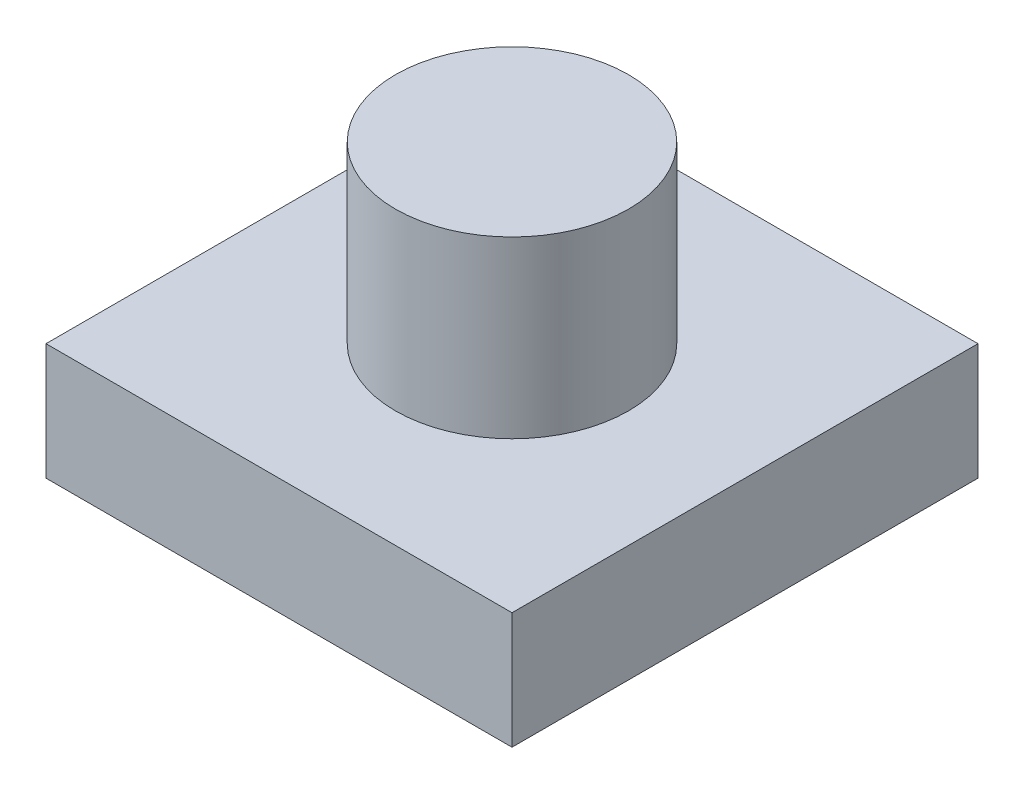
ISO-10303-21;
HEADER;
FILE_DESCRIPTION(('STEP AP214'),'2;1');
FILE_NAME('part.step','',(''),(''),'','','');
FILE_SCHEMA(('AUTOMOTIVE_DESIGN { 1 0 10303 214 1 1 1 1 }'));
ENDSEC;
DATA;
#1=APPLICATION_CONTEXT('core data for automotive mechanical design processes');
#2=APPLICATION_PROTOCOL_DEFINITION('international standard','automotive_design',2000,#1);
#3=PRODUCT_CONTEXT('',#1,'mechanical');
#4=PRODUCT('Part','Part','',(#3));
#5=PRODUCT_RELATED_PRODUCT_CATEGORY('part','',(#4));
#6=PRODUCT_DEFINITION_FORMATION('','',#4);
#7=PRODUCT_DEFINITION_CONTEXT('part definition',#1,'design');
#8=PRODUCT_DEFINITION('design','',#6,#7);
#9=PRODUCT_DEFINITION_SHAPE('','',#8);
#10=(LENGTH_UNIT() NAMED_UNIT(*) SI_UNIT(.MILLI.,.METRE.));
#11=(NAMED_UNIT(*) PLANE_ANGLE_UNIT() SI_UNIT($,.RADIAN.));
#12=(NAMED_UNIT(*) SI_UNIT($,.STERADIAN.) SOLID_ANGLE_UNIT());
#13=UNCERTAINTY_MEASURE_WITH_UNIT(LENGTH_MEASURE(1.E-05),#10,'distance_accuracy_value','');
#14=(GEOMETRIC_REPRESENTATION_CONTEXT(3) GLOBAL_UNCERTAINTY_ASSIGNED_CONTEXT((#13)) GLOBAL_UNIT_ASSIGNED_CONTEXT((#10,
#11,#12)) REPRESENTATION_CONTEXT('',''));
#15=CARTESIAN_POINT('',(0.,0.,0.));
#16=DIRECTION('',(0.,0.,1.));
#17=DIRECTION('',(1.,0.,0.));
#18=AXIS2_PLACEMENT_3D('',#15,#16,#17);
#19=CARTESIAN_POINT('',(6.35,3.175,6.35));
#20=DIRECTION('',(-1.,0.,0.));
#21=DIRECTION('',(0.,0.,1.));
#22=AXIS2_PLACEMENT_3D('',#19,#20,#21);
#23=PLANE('',#22);
#24=DIRECTION('',(0.,0.,-1.));
#25=VECTOR('',#24,1.);
#26=CARTESIAN_POINT('',(6.35,0.,6.35));
#27=LINE('',#26,#25);
#28=CARTESIAN_POINT('',(6.35,0.,6.35));
#29=VERTEX_POINT('',#28);
#30=CARTESIAN_POINT('',(6.35,0.,-6.35));
#31=VERTEX_POINT('',#30);
#32=EDGE_CURVE('E101',#29,#31,#27,.T.);
#33=ORIENTED_EDGE('',*,*,#32,.T.);
#34=DIRECTION('',(0.,-1.,0.));
#35=VECTOR('',#34,1.);
#36=CARTESIAN_POINT('',(6.35,3.175,-6.35));
#37=LINE('',#36,#35);
#38=CARTESIAN_POINT('',(6.35,3.175,-6.35));
#39=VERTEX_POINT('',#38);
#40=EDGE_CURVE('E38',#39,#31,#37,.T.);
#41=ORIENTED_EDGE('',*,*,#40,.F.);
#42=DIRECTION('',(0.,0.,-1.));
#43=VECTOR('',#42,1.);
#44=CARTESIAN_POINT('',(6.35,3.175,6.35));
#45=LINE('',#44,#43);
#46=CARTESIAN_POINT('',(6.35,3.175,6.35));
#47=VERTEX_POINT('',#46);
#48=EDGE_CURVE('E88',#47,#39,#45,.T.);
#49=ORIENTED_EDGE('',*,*,#48,.F.);
#50=DIRECTION('',(0.,-1.,0.));
#51=VECTOR('',#50,1.);
#52=CARTESIAN_POINT('',(6.35,3.175,6.35));
#53=LINE('',#52,#51);
#54=EDGE_CURVE('E97',#47,#29,#53,.T.);
#55=ORIENTED_EDGE('',*,*,#54,.T.);
#56=EDGE_LOOP('',(#33,#41,#49,#55));
#57=FACE_BOUND('',#56,.T.);
#58=ADVANCED_FACE('F35',(#57),#23,.F.);
#59=CARTESIAN_POINT('',(-6.35,3.175,-6.35));
#60=DIRECTION('',(0.,0.,1.));
#61=DIRECTION('',(1.,0.,0.));
#62=AXIS2_PLACEMENT_3D('',#59,#60,#61);
#63=PLANE('',#62);
#64=DIRECTION('',(-1.,0.,0.));
#65=VECTOR('',#64,1.);
#66=CARTESIAN_POINT('',(-6.35,0.,-6.35));
#67=LINE('',#66,#65);
#68=CARTESIAN_POINT('',(-6.35,0.,-6.35));
#69=VERTEX_POINT('',#68);
#70=EDGE_CURVE('E93',#31,#69,#67,.T.);
#71=ORIENTED_EDGE('',*,*,#70,.T.);
#72=DIRECTION('',(0.,-1.,0.));
#73=VECTOR('',#72,1.);
#74=CARTESIAN_POINT('',(-6.35,3.175,-6.35));
#75=LINE('',#74,#73);
#76=CARTESIAN_POINT('',(-6.35,3.175,-6.35));
#77=VERTEX_POINT('',#76);
#78=EDGE_CURVE('E91',#77,#69,#75,.T.);
#79=ORIENTED_EDGE('',*,*,#78,.F.);
#80=DIRECTION('',(-1.,0.,0.));
#81=VECTOR('',#80,1.);
#82=CARTESIAN_POINT('',(-6.35,3.175,-6.35));
#83=LINE('',#82,#81);
#84=EDGE_CURVE('E83',#39,#77,#83,.T.);
#85=ORIENTED_EDGE('',*,*,#84,.F.);
#86=ORIENTED_EDGE('',*,*,#40,.T.);
#87=EDGE_LOOP('',(#71,#79,#85,#86));
#88=FACE_BOUND('',#87,.T.);
#89=ADVANCED_FACE('F92',(#88),#63,.F.);
#90=CARTESIAN_POINT('',(-6.35,3.175,6.35));
#91=DIRECTION('',(1.,0.,0.));
#92=DIRECTION('',(0.,0.,-1.));
#93=AXIS2_PLACEMENT_3D('',#90,#91,#92);
#94=PLANE('',#93);
#95=DIRECTION('',(0.,0.,1.));
#96=VECTOR('',#95,1.);
#97=CARTESIAN_POINT('',(-6.35,0.,6.35));
#98=LINE('',#97,#96);
#99=CARTESIAN_POINT('',(-6.35,0.,6.35));
#100=VERTEX_POINT('',#99);
#101=EDGE_CURVE('E69',#69,#100,#98,.T.);
#102=ORIENTED_EDGE('',*,*,#101,.T.);
#103=DIRECTION('',(0.,-1.,0.));
#104=VECTOR('',#103,1.);
#105=CARTESIAN_POINT('',(-6.35,3.175,6.35));
#106=LINE('',#105,#104);
#107=CARTESIAN_POINT('',(-6.35,3.175,6.35));
#108=VERTEX_POINT('',#107);
#109=EDGE_CURVE('E94',#108,#100,#106,.T.);
#110=ORIENTED_EDGE('',*,*,#109,.F.);
#111=DIRECTION('',(0.,0.,1.));
#112=VECTOR('',#111,1.);
#113=CARTESIAN_POINT('',(-6.35,3.175,6.35));
#114=LINE('',#113,#112);
#115=EDGE_CURVE('E86',#77,#108,#114,.T.);
#116=ORIENTED_EDGE('',*,*,#115,.F.);
#117=ORIENTED_EDGE('',*,*,#78,.T.);
#118=EDGE_LOOP('',(#102,#110,#116,#117));
#119=FACE_BOUND('',#118,.T.);
#120=ADVANCED_FACE('F95',(#119),#94,.F.);
#121=CARTESIAN_POINT('',(-6.35,3.175,6.35));
#122=DIRECTION('',(0.,0.,-1.));
#123=DIRECTION('',(-1.,0.,0.));
#124=AXIS2_PLACEMENT_3D('',#121,#122,#123);
#125=PLANE('',#124);
#126=DIRECTION('',(1.,0.,0.));
#127=VECTOR('',#126,1.);
#128=CARTESIAN_POINT('',(-6.35,0.,6.35));
#129=LINE('',#128,#127);
#130=EDGE_CURVE('E75',#100,#29,#129,.T.);
#131=ORIENTED_EDGE('',*,*,#130,.T.);
#132=ORIENTED_EDGE('',*,*,#54,.F.);
#133=DIRECTION('',(1.,0.,0.));
#134=VECTOR('',#133,1.);
#135=CARTESIAN_POINT('',(-6.35,3.175,6.35));
#136=LINE('',#135,#134);
#137=EDGE_CURVE('E52',#108,#47,#136,.T.);
#138=ORIENTED_EDGE('',*,*,#137,.F.);
#139=ORIENTED_EDGE('',*,*,#109,.T.);
#140=EDGE_LOOP('',(#131,#132,#138,#139));
#141=FACE_BOUND('',#140,.T.);
#142=ADVANCED_FACE('F109',(#141),#125,.F.);
#143=CARTESIAN_POINT('',(0.,3.175,0.));
#144=DIRECTION('',(0.,-1.,0.));
#145=DIRECTION('',(0.,0.,-1.));
#146=AXIS2_PLACEMENT_3D('',#143,#144,#145);
#147=PLANE('',#146);
#148=CARTESIAN_POINT('',(0.,3.175,0.));
#149=DIRECTION('',(0.,1.,0.));
#150=DIRECTION('',(0.,0.,1.));
#151=AXIS2_PLACEMENT_3D('',#148,#149,#150);
#152=CIRCLE('',#151,3.175);
#153=CARTESIAN_POINT('',(0.,3.175,3.175));
#154=VERTEX_POINT('',#153);
#155=EDGE_CURVE('E11',#154,#154,#152,.T.);
#156=ORIENTED_EDGE('',*,*,#155,.F.);
#157=EDGE_LOOP('',(#156));
#158=FACE_BOUND('',#157,.T.);
#159=ORIENTED_EDGE('',*,*,#48,.T.);
#160=ORIENTED_EDGE('',*,*,#84,.T.);
#161=ORIENTED_EDGE('',*,*,#115,.T.);
#162=ORIENTED_EDGE('',*,*,#137,.T.);
#163=EDGE_LOOP('',(#159,#160,#161,#162));
#164=FACE_BOUND('',#163,.T.);
#165=ADVANCED_FACE('F84',(#158,#164),#147,.F.);
#166=CARTESIAN_POINT('',(0.,0.,0.));
#167=DIRECTION('',(0.,-1.,0.));
#168=DIRECTION('',(0.,0.,-1.));
#169=AXIS2_PLACEMENT_3D('',#166,#167,#168);
#170=PLANE('',#169);
#171=ORIENTED_EDGE('',*,*,#32,.F.);
#172=ORIENTED_EDGE('',*,*,#130,.F.);
#173=ORIENTED_EDGE('',*,*,#101,.F.);
#174=ORIENTED_EDGE('',*,*,#70,.F.);
#175=EDGE_LOOP('',(#171,#172,#173,#174));
#176=FACE_BOUND('',#175,.T.);
#177=ADVANCED_FACE('F112',(#176),#170,.T.);
#178=CARTESIAN_POINT('',(0.,7.9375,0.));
#179=DIRECTION('',(0.,-1.,0.));
#180=DIRECTION('',(0.,0.,-1.));
#181=AXIS2_PLACEMENT_3D('',#178,#179,#180);
#182=CYLINDRICAL_SURFACE('',#181,3.175);
#183=CARTESIAN_POINT('',(0.,7.9375,0.));
#184=DIRECTION('',(0.,1.,0.));
#185=DIRECTION('',(0.,0.,1.));
#186=AXIS2_PLACEMENT_3D('',#183,#184,#185);
#187=CIRCLE('',#186,3.175);
#188=CARTESIAN_POINT('',(0.,7.9375,3.175));
#189=VERTEX_POINT('',#188);
#190=EDGE_CURVE('E104',#189,#189,#187,.T.);
#191=ORIENTED_EDGE('',*,*,#190,.F.);
#192=EDGE_LOOP('',(#191));
#193=FACE_BOUND('',#192,.T.);
#194=ORIENTED_EDGE('',*,*,#155,.T.);
#195=EDGE_LOOP('',(#194));
#196=FACE_BOUND('',#195,.T.);
#197=ADVANCED_FACE('F120',(#193,#196),#182,.T.);
#198=CARTESIAN_POINT('',(0.,7.9375,0.));
#199=DIRECTION('',(0.,1.,0.));
#200=DIRECTION('',(0.,0.,1.));
#201=AXIS2_PLACEMENT_3D('',#198,#199,#200);
#202=PLANE('',#201);
#203=ORIENTED_EDGE('',*,*,#190,.T.);
#204=EDGE_LOOP('',(#203));
#205=FACE_BOUND('',#204,.T.);
#206=ADVANCED_FACE('F118',(#205),#202,.T.);
#207=CLOSED_SHELL('',(#58,#89,#120,#142,#165,#177,#197,#206));
#208=MANIFOLD_SOLID_BREP('B2',#207);
#209=ADVANCED_BREP_SHAPE_REPRESENTATION('',(#18,#208),#14);
#210=SHAPE_DEFINITION_REPRESENTATION(#9,#209);
ENDSEC;
END-ISO-10303-21;
